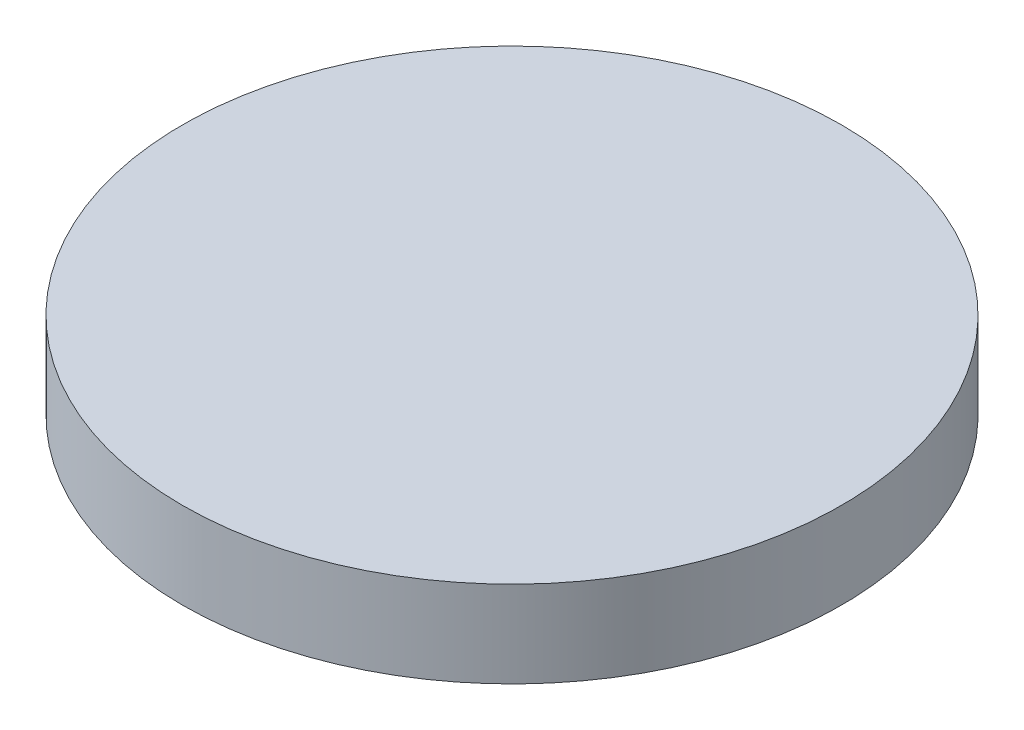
from build123d import *

# Parameters (mm, degrees)
SKETCH_1_R      = 12.303125
EXTRUDE_1_DEPTH = 3.2258


with BuildPart() as part:
    # Sketch 1 → Extrude 1 (new body)
    with BuildSketch(Plane(origin=(0, 0, 0), x_dir=(1, 0, 0), z_dir=(0, 1, 0))):
        with Locations(Location((0, 0, 0), (0, 0, 270))):
            Circle(SKETCH_1_R)
    extrude(amount=EXTRUDE_1_DEPTH)


solid = part.part
